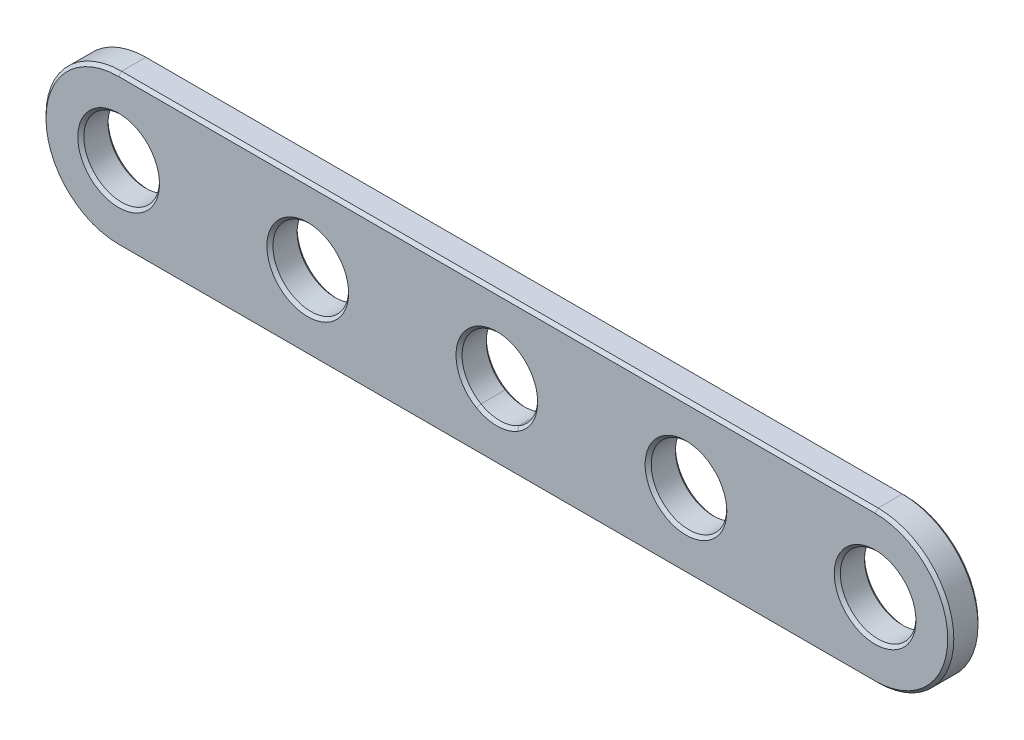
from build123d import *

# Parameters (mm, degrees)
BASE_EXTRUDE_DEPTH = 20
SKETCH2_R          = 25
CUT_EXTRUDE1_DEPTH = 560.374650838
LPATTERN1_COUNT    = 5
LPATTERN1_PITCH    = 125
CHAMFER1_SIZE      = 2


with BuildPart() as part:
    # Sketch1 → Base-Extrude (new body)
    with BuildSketch(Plane.XY):
        with BuildLine():
            Line((0, 0), (500, 0))
            ThreePointArc((500, 0), (550, 50), (500, 100))
            Line((500, 100), (0, 100))
            ThreePointArc((0, 100), (-50, 50), (0, 0))
        make_face()
    extrude(amount=BASE_EXTRUDE_DEPTH)

    # Sketch2 → Cut-Extrude1 (cut, through all)
    with BuildSketch(Plane.XY.offset(20)):
        with Locations((0, 50)):
            Circle(SKETCH2_R)
    cut_extrude1 = extrude(amount=-CUT_EXTRUDE1_DEPTH, mode=Mode.SUBTRACT)

    # LPattern1: Cut-Extrude1 ×5
    with Locations(*[(i * LPATTERN1_PITCH, 0, 0) for i in range(1, LPATTERN1_COUNT)]):
        add(cut_extrude1, mode=Mode.SUBTRACT)

    # Chamfer1
    chamfer1_edges = [part.edges().sort_by_distance(p)[0] for p in [
        (550, 50, 20),
        (250, 100, 20),
        (-25, 50, 0),
        (-25, 50, 20),
        (100, 50, 0),
        (100, 50, 20),
        (225, 50, 0),
        (225, 50, 20),
        (350, 50, 0),
        (350, 50, 20),
        (475, 50, 0),
        (475, 50, 20),
        (225, 50, 0),
        (225, 50, 0),
        (225, 50, 0),
        (225, 50, 20),
        (225, 50, 20),
        (225, 50, 20),
        (-50, 50, 20),
        (250, 100, 0),
        (550, 50, 0),
        (250, 0, 0),
        (-50, 50, 0),
        (250, 0, 20),
    ]]
    chamfer(chamfer1_edges, length=CHAMFER1_SIZE)


solid = part.part
